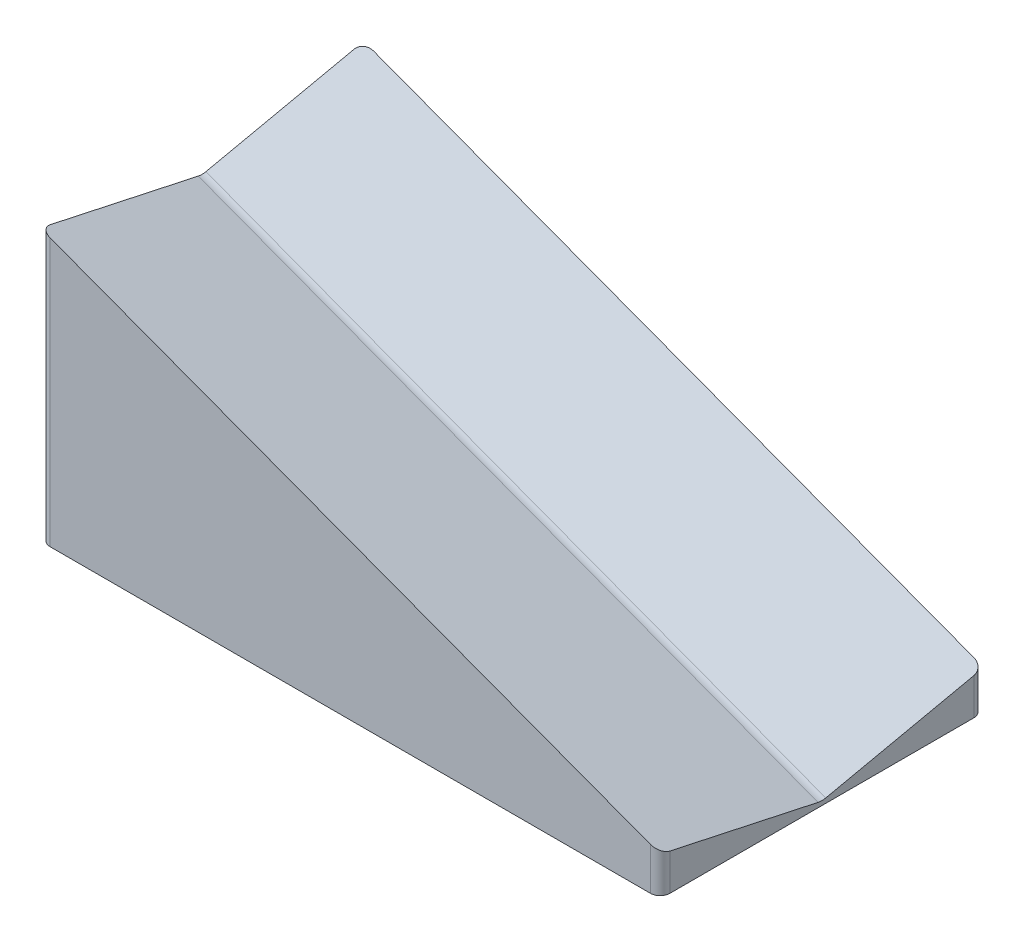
ISO-10303-21;
HEADER;
FILE_DESCRIPTION(('STEP AP214'),'2;1');
FILE_NAME('part.step','',(''),(''),'','','');
FILE_SCHEMA(('AUTOMOTIVE_DESIGN { 1 0 10303 214 1 1 1 1 }'));
ENDSEC;
DATA;
#1=APPLICATION_CONTEXT('core data for automotive mechanical design processes');
#2=APPLICATION_PROTOCOL_DEFINITION('international standard','automotive_design',2000,#1);
#3=PRODUCT_CONTEXT('',#1,'mechanical');
#4=PRODUCT('Part','Part','',(#3));
#5=PRODUCT_RELATED_PRODUCT_CATEGORY('part','',(#4));
#6=PRODUCT_DEFINITION_FORMATION('','',#4);
#7=PRODUCT_DEFINITION_CONTEXT('part definition',#1,'design');
#8=PRODUCT_DEFINITION('design','',#6,#7);
#9=PRODUCT_DEFINITION_SHAPE('','',#8);
#10=(LENGTH_UNIT() NAMED_UNIT(*) SI_UNIT(.MILLI.,.METRE.));
#11=(NAMED_UNIT(*) PLANE_ANGLE_UNIT() SI_UNIT($,.RADIAN.));
#12=(NAMED_UNIT(*) SI_UNIT($,.STERADIAN.) SOLID_ANGLE_UNIT());
#13=UNCERTAINTY_MEASURE_WITH_UNIT(LENGTH_MEASURE(1.E-05),#10,'distance_accuracy_value','');
#14=(GEOMETRIC_REPRESENTATION_CONTEXT(3) GLOBAL_UNCERTAINTY_ASSIGNED_CONTEXT((#13)) GLOBAL_UNIT_ASSIGNED_CONTEXT((#10,
#11,#12)) REPRESENTATION_CONTEXT('',''));
#15=CARTESIAN_POINT('',(0.,0.,0.));
#16=DIRECTION('',(0.,0.,1.));
#17=DIRECTION('',(1.,0.,0.));
#18=AXIS2_PLACEMENT_3D('',#15,#16,#17);
#19=CARTESIAN_POINT('',(0.,70.,41.75));
#20=DIRECTION('',(1.,0.,0.));
#21=DIRECTION('',(0.,1.,0.));
#22=AXIS2_PLACEMENT_3D('',#19,#20,#21);
#23=PLANE('',#22);
#24=DIRECTION('',(0.,-0.210728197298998,0.977544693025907));
#25=VECTOR('',#24,1.);
#26=CARTESIAN_POINT('',(0.,70.,-41.75));
#27=LINE('',#26,#25);
#28=CARTESIAN_POINT('',(0.,69.4610778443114,-39.25));
#29=VERTEX_POINT('',#28);
#30=CARTESIAN_POINT('',(0.,61.2132550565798,-0.989266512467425));
#31=VERTEX_POINT('',#30);
#32=EDGE_CURVE('E122',#29,#31,#27,.T.);
#33=ORIENTED_EDGE('',*,*,#32,.F.);
#34=DIRECTION('',(0.,-1.,0.));
#35=VECTOR('',#34,1.);
#36=CARTESIAN_POINT('',(0.,70.,-39.25));
#37=LINE('',#36,#35);
#38=CARTESIAN_POINT('',(0.,0.,-39.25));
#39=VERTEX_POINT('',#38);
#40=EDGE_CURVE('E135',#29,#39,#37,.T.);
#41=ORIENTED_EDGE('',*,*,#40,.T.);
#42=DIRECTION('',(0.,0.,-1.));
#43=VECTOR('',#42,1.);
#44=CARTESIAN_POINT('',(0.,0.,41.75));
#45=LINE('',#44,#43);
#46=CARTESIAN_POINT('',(0.,0.,39.25));
#47=VERTEX_POINT('',#46);
#48=EDGE_CURVE('E149',#47,#39,#45,.T.);
#49=ORIENTED_EDGE('',*,*,#48,.F.);
#50=DIRECTION('',(0.,-1.,0.));
#51=VECTOR('',#50,1.);
#52=CARTESIAN_POINT('',(0.,70.,39.25));
#53=LINE('',#52,#51);
#54=CARTESIAN_POINT('',(0.,69.4610778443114,39.25));
#55=VERTEX_POINT('',#54);
#56=EDGE_CURVE('E144',#47,#55,#53,.F.);
#57=ORIENTED_EDGE('',*,*,#56,.T.);
#58=DIRECTION('',(0.,0.210728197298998,0.977544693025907));
#59=VECTOR('',#58,1.);
#60=CARTESIAN_POINT('',(0.,61.,0.));
#61=LINE('',#60,#59);
#62=CARTESIAN_POINT('',(0.,61.2132550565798,0.989266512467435));
#63=VERTEX_POINT('',#62);
#64=EDGE_CURVE('E138',#63,#55,#61,.T.);
#65=ORIENTED_EDGE('',*,*,#64,.F.);
#66=CARTESIAN_POINT('',(0.,66.4476943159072,0.));
#67=DIRECTION('',(1.,0.,0.));
#68=DIRECTION('',(0.,1.,0.));
#69=AXIS2_PLACEMENT_3D('',#66,#67,#68);
#70=ELLIPSE('',#69,5.34000234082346,5.);
#71=EDGE_CURVE('E12',#63,#31,#70,.T.);
#72=ORIENTED_EDGE('',*,*,#71,.T.);
#73=EDGE_LOOP('',(#33,#41,#49,#57,#65,#72));
#74=FACE_BOUND('',#73,.T.);
#75=ADVANCED_FACE('F41',(#74),#23,.F.);
#76=CARTESIAN_POINT('',(160.,0.,41.75));
#77=DIRECTION('',(-1.,0.,0.));
#78=DIRECTION('',(0.,0.,1.));
#79=AXIS2_PLACEMENT_3D('',#76,#77,#78);
#80=PLANE('',#79);
#81=DIRECTION('',(0.,0.,-1.));
#82=VECTOR('',#81,1.);
#83=CARTESIAN_POINT('',(160.,0.,41.75));
#84=LINE('',#83,#82);
#85=CARTESIAN_POINT('',(160.,0.,39.25));
#86=VERTEX_POINT('',#85);
#87=CARTESIAN_POINT('',(160.,0.,-39.25));
#88=VERTEX_POINT('',#87);
#89=EDGE_CURVE('E215',#86,#88,#84,.T.);
#90=ORIENTED_EDGE('',*,*,#89,.T.);
#91=DIRECTION('',(0.,1.,0.));
#92=VECTOR('',#91,1.);
#93=CARTESIAN_POINT('',(160.,0.,-39.25));
#94=LINE('',#93,#92);
#95=CARTESIAN_POINT('',(160.,9.46107784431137,-39.25));
#96=VERTEX_POINT('',#95);
#97=EDGE_CURVE('E175',#88,#96,#94,.T.);
#98=ORIENTED_EDGE('',*,*,#97,.T.);
#99=DIRECTION('',(0.,0.210728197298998,-0.977544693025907));
#100=VECTOR('',#99,1.);
#101=CARTESIAN_POINT('',(160.,10.,-41.75));
#102=LINE('',#101,#100);
#103=CARTESIAN_POINT('',(160.,1.21325505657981,-0.989266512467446));
#104=VERTEX_POINT('',#103);
#105=EDGE_CURVE('E172',#104,#96,#102,.T.);
#106=ORIENTED_EDGE('',*,*,#105,.F.);
#107=CARTESIAN_POINT('',(160.,6.44769431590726,0.));
#108=DIRECTION('',(-1.,0.,0.));
#109=DIRECTION('',(0.,1.,0.));
#110=AXIS2_PLACEMENT_3D('',#107,#108,#109);
#111=ELLIPSE('',#110,5.34000234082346,5.);
#112=CARTESIAN_POINT('',(160.,1.2132550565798,0.989266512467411));
#113=VERTEX_POINT('',#112);
#114=EDGE_CURVE('E49',#104,#113,#111,.T.);
#115=ORIENTED_EDGE('',*,*,#114,.T.);
#116=DIRECTION('',(0.,-0.210728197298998,-0.977544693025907));
#117=VECTOR('',#116,1.);
#118=CARTESIAN_POINT('',(160.,1.,0.));
#119=LINE('',#118,#117);
#120=CARTESIAN_POINT('',(160.,9.46107784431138,39.25));
#121=VERTEX_POINT('',#120);
#122=EDGE_CURVE('E139',#121,#113,#119,.T.);
#123=ORIENTED_EDGE('',*,*,#122,.F.);
#124=DIRECTION('',(0.,1.,0.));
#125=VECTOR('',#124,1.);
#126=CARTESIAN_POINT('',(160.,0.,39.25));
#127=LINE('',#126,#125);
#128=EDGE_CURVE('E129',#121,#86,#127,.F.);
#129=ORIENTED_EDGE('',*,*,#128,.T.);
#130=EDGE_LOOP('',(#90,#98,#106,#115,#123,#129));
#131=FACE_BOUND('',#130,.T.);
#132=ADVANCED_FACE('F231',(#131),#80,.F.);
#133=CARTESIAN_POINT('',(0.,0.,41.75));
#134=DIRECTION('',(0.,1.,0.));
#135=DIRECTION('',(0.,0.,1.));
#136=AXIS2_PLACEMENT_3D('',#133,#134,#135);
#137=PLANE('',#136);
#138=ORIENTED_EDGE('',*,*,#48,.T.);
#139=CARTESIAN_POINT('',(2.5,0.,-39.25));
#140=DIRECTION('',(0.,1.,0.));
#141=DIRECTION('',(0.,0.,1.));
#142=AXIS2_PLACEMENT_3D('',#139,#140,#141);
#143=CIRCLE('',#142,2.5);
#144=CARTESIAN_POINT('',(2.5,0.,-41.75));
#145=VERTEX_POINT('',#144);
#146=EDGE_CURVE('E142',#39,#145,#143,.F.);
#147=ORIENTED_EDGE('',*,*,#146,.T.);
#148=DIRECTION('',(1.,0.,0.));
#149=VECTOR('',#148,1.);
#150=CARTESIAN_POINT('',(0.,0.,-41.75));
#151=LINE('',#150,#149);
#152=CARTESIAN_POINT('',(157.5,0.,-41.75));
#153=VERTEX_POINT('',#152);
#154=EDGE_CURVE('E159',#145,#153,#151,.T.);
#155=ORIENTED_EDGE('',*,*,#154,.T.);
#156=CARTESIAN_POINT('',(157.5,0.,-39.25));
#157=DIRECTION('',(0.,1.,0.));
#158=DIRECTION('',(0.,0.,1.));
#159=AXIS2_PLACEMENT_3D('',#156,#157,#158);
#160=CIRCLE('',#159,2.5);
#161=EDGE_CURVE('E153',#153,#88,#160,.F.);
#162=ORIENTED_EDGE('',*,*,#161,.T.);
#163=ORIENTED_EDGE('',*,*,#89,.F.);
#164=CARTESIAN_POINT('',(157.5,0.,39.25));
#165=DIRECTION('',(0.,1.,0.));
#166=DIRECTION('',(0.,0.,1.));
#167=AXIS2_PLACEMENT_3D('',#164,#165,#166);
#168=CIRCLE('',#167,2.5);
#169=CARTESIAN_POINT('',(157.5,0.,41.75));
#170=VERTEX_POINT('',#169);
#171=EDGE_CURVE('E146',#86,#170,#168,.F.);
#172=ORIENTED_EDGE('',*,*,#171,.T.);
#173=DIRECTION('',(1.,0.,0.));
#174=VECTOR('',#173,1.);
#175=CARTESIAN_POINT('',(0.,0.,41.75));
#176=LINE('',#175,#174);
#177=CARTESIAN_POINT('',(2.5,0.,41.75));
#178=VERTEX_POINT('',#177);
#179=EDGE_CURVE('E182',#178,#170,#176,.T.);
#180=ORIENTED_EDGE('',*,*,#179,.F.);
#181=CARTESIAN_POINT('',(2.5,0.,39.25));
#182=DIRECTION('',(0.,1.,0.));
#183=DIRECTION('',(0.,0.,1.));
#184=AXIS2_PLACEMENT_3D('',#181,#182,#183);
#185=CIRCLE('',#184,2.5);
#186=EDGE_CURVE('E143',#178,#47,#185,.F.);
#187=ORIENTED_EDGE('',*,*,#186,.T.);
#188=EDGE_LOOP('',(#138,#147,#155,#162,#163,#172,#180,#187));
#189=FACE_BOUND('',#188,.T.);
#190=ADVANCED_FACE('F212',(#189),#137,.F.);
#191=CARTESIAN_POINT('',(0.,0.,41.75));
#192=DIRECTION('',(0.,0.,1.));
#193=DIRECTION('',(1.,0.,0.));
#194=AXIS2_PLACEMENT_3D('',#191,#192,#193);
#195=PLANE('',#194);
#196=ORIENTED_EDGE('',*,*,#179,.T.);
#197=DIRECTION('',(0.,1.,0.));
#198=VECTOR('',#197,1.);
#199=CARTESIAN_POINT('',(157.5,10.,41.75));
#200=LINE('',#199,#198);
#201=CARTESIAN_POINT('',(157.5,10.9375,41.75));
#202=VERTEX_POINT('',#201);
#203=EDGE_CURVE('E185',#170,#202,#200,.T.);
#204=ORIENTED_EDGE('',*,*,#203,.T.);
#205=DIRECTION('',(-0.936329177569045,0.351123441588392,0.));
#206=VECTOR('',#205,1.);
#207=CARTESIAN_POINT('',(160.,10.,41.75));
#208=LINE('',#207,#206);
#209=CARTESIAN_POINT('',(2.49999999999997,69.0625,41.75));
#210=VERTEX_POINT('',#209);
#211=EDGE_CURVE('E179',#202,#210,#208,.T.);
#212=ORIENTED_EDGE('',*,*,#211,.T.);
#213=DIRECTION('',(0.,-1.,0.));
#214=VECTOR('',#213,1.);
#215=CARTESIAN_POINT('',(2.5,0.,41.75));
#216=LINE('',#215,#214);
#217=EDGE_CURVE('E178',#210,#178,#216,.T.);
#218=ORIENTED_EDGE('',*,*,#217,.T.);
#219=EDGE_LOOP('',(#196,#204,#212,#218));
#220=FACE_BOUND('',#219,.T.);
#221=ADVANCED_FACE('F209',(#220),#195,.T.);
#222=CARTESIAN_POINT('',(0.,0.,-41.75));
#223=DIRECTION('',(0.,0.,1.));
#224=DIRECTION('',(1.,0.,0.));
#225=AXIS2_PLACEMENT_3D('',#222,#223,#224);
#226=PLANE('',#225);
#227=ORIENTED_EDGE('',*,*,#154,.F.);
#228=DIRECTION('',(0.,-1.,0.));
#229=VECTOR('',#228,1.);
#230=CARTESIAN_POINT('',(2.5,0.,-41.75));
#231=LINE('',#230,#229);
#232=CARTESIAN_POINT('',(2.49999999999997,69.0625,-41.75));
#233=VERTEX_POINT('',#232);
#234=EDGE_CURVE('E225',#145,#233,#231,.F.);
#235=ORIENTED_EDGE('',*,*,#234,.T.);
#236=DIRECTION('',(-0.936329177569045,0.351123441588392,0.));
#237=VECTOR('',#236,1.);
#238=CARTESIAN_POINT('',(160.,10.,-41.75));
#239=LINE('',#238,#237);
#240=CARTESIAN_POINT('',(157.5,10.9375,-41.75));
#241=VERTEX_POINT('',#240);
#242=EDGE_CURVE('E125',#241,#233,#239,.T.);
#243=ORIENTED_EDGE('',*,*,#242,.F.);
#244=DIRECTION('',(0.,1.,0.));
#245=VECTOR('',#244,1.);
#246=CARTESIAN_POINT('',(157.5,0.,-41.75));
#247=LINE('',#246,#245);
#248=EDGE_CURVE('E156',#241,#153,#247,.F.);
#249=ORIENTED_EDGE('',*,*,#248,.T.);
#250=EDGE_LOOP('',(#227,#235,#243,#249));
#251=FACE_BOUND('',#250,.T.);
#252=ADVANCED_FACE('F224',(#251),#226,.F.);
#253=CARTESIAN_POINT('',(19.2697309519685,51.3859492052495,11.0772106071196));
#254=DIRECTION('',(0.344182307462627,0.917819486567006,0.197853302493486));
#255=DIRECTION('',(-0.936329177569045,0.351123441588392,0.));
#256=AXIS2_PLACEMENT_3D('',#253,#254,#255);
#257=PLANE('',#256);
#258=ORIENTED_EDGE('',*,*,#32,.T.);
#259=DIRECTION('',(0.936329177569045,-0.351123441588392,0.));
#260=VECTOR('',#259,1.);
#261=CARTESIAN_POINT('',(160.070111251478,1.18696333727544,-0.989266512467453));
#262=LINE('',#261,#260);
#263=EDGE_CURVE('E192',#31,#104,#262,.T.);
#264=ORIENTED_EDGE('',*,*,#263,.T.);
#265=ORIENTED_EDGE('',*,*,#105,.T.);
#266=CARTESIAN_POINT('',(157.5,10.3985778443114,-39.25));
#267=DIRECTION('',(0.344182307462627,0.917819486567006,0.197853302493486));
#268=DIRECTION('',(-0.795714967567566,0.396997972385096,-0.457416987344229));
#269=AXIS2_PLACEMENT_3D('',#266,#267,#268);
#270=ELLIPSE('',#269,2.72384715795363,2.5);
#271=EDGE_CURVE('E130',#96,#241,#270,.T.);
#272=ORIENTED_EDGE('',*,*,#271,.T.);
#273=ORIENTED_EDGE('',*,*,#242,.T.);
#274=CARTESIAN_POINT('',(2.5,68.5235778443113,-39.25));
#275=DIRECTION('',(0.344182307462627,0.917819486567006,0.197853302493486));
#276=DIRECTION('',(0.795714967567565,-0.396997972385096,0.457416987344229));
#277=AXIS2_PLACEMENT_3D('',#274,#275,#276);
#278=ELLIPSE('',#277,2.72384715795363,2.5);
#279=EDGE_CURVE('E118',#233,#29,#278,.T.);
#280=ORIENTED_EDGE('',*,*,#279,.T.);
#281=EDGE_LOOP('',(#258,#264,#265,#272,#273,#280));
#282=FACE_BOUND('',#281,.T.);
#283=ADVANCED_FACE('F120',(#282),#257,.T.);
#284=CARTESIAN_POINT('',(19.2697309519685,51.3859492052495,-11.0772106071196));
#285=DIRECTION('',(0.344182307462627,0.917819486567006,-0.197853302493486));
#286=DIRECTION('',(-0.936329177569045,0.351123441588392,0.));
#287=AXIS2_PLACEMENT_3D('',#284,#285,#286);
#288=PLANE('',#287);
#289=ORIENTED_EDGE('',*,*,#122,.T.);
#290=DIRECTION('',(0.936329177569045,-0.351123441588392,0.));
#291=VECTOR('',#290,1.);
#292=CARTESIAN_POINT('',(0.0701112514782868,61.1869633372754,0.98926651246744));
#293=LINE('',#292,#291);
#294=EDGE_CURVE('E56',#113,#63,#293,.F.);
#295=ORIENTED_EDGE('',*,*,#294,.T.);
#296=ORIENTED_EDGE('',*,*,#64,.T.);
#297=CARTESIAN_POINT('',(2.5,68.5235778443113,39.25));
#298=DIRECTION('',(0.344182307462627,0.917819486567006,-0.197853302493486));
#299=DIRECTION('',(-0.795714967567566,0.396997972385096,0.45741698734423));
#300=AXIS2_PLACEMENT_3D('',#297,#298,#299);
#301=ELLIPSE('',#300,2.72384715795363,2.5);
#302=EDGE_CURVE('E188',#55,#210,#301,.T.);
#303=ORIENTED_EDGE('',*,*,#302,.T.);
#304=ORIENTED_EDGE('',*,*,#211,.F.);
#305=CARTESIAN_POINT('',(157.5,10.3985778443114,39.25));
#306=DIRECTION('',(0.344182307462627,0.917819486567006,-0.197853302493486));
#307=DIRECTION('',(0.795714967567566,-0.396997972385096,-0.457416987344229));
#308=AXIS2_PLACEMENT_3D('',#305,#306,#307);
#309=ELLIPSE('',#308,2.72384715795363,2.5);
#310=EDGE_CURVE('E190',#202,#121,#309,.T.);
#311=ORIENTED_EDGE('',*,*,#310,.T.);
#312=EDGE_LOOP('',(#289,#295,#296,#303,#304,#311));
#313=FACE_BOUND('',#312,.T.);
#314=ADVANCED_FACE('F199',(#313),#288,.T.);
#315=CARTESIAN_POINT('',(2.5,70.,-39.25));
#316=DIRECTION('',(0.,-1.,0.));
#317=DIRECTION('',(1.,0.,0.));
#318=AXIS2_PLACEMENT_3D('',#315,#316,#317);
#319=CYLINDRICAL_SURFACE('',#318,2.5);
#320=ORIENTED_EDGE('',*,*,#279,.F.);
#321=ORIENTED_EDGE('',*,*,#234,.F.);
#322=ORIENTED_EDGE('',*,*,#146,.F.);
#323=ORIENTED_EDGE('',*,*,#40,.F.);
#324=EDGE_LOOP('',(#320,#321,#322,#323));
#325=FACE_BOUND('',#324,.T.);
#326=ADVANCED_FACE('F141',(#325),#319,.T.);
#327=CARTESIAN_POINT('',(157.5,0.,-39.25));
#328=DIRECTION('',(0.,1.,0.));
#329=DIRECTION('',(0.,0.,1.));
#330=AXIS2_PLACEMENT_3D('',#327,#328,#329);
#331=CYLINDRICAL_SURFACE('',#330,2.5);
#332=ORIENTED_EDGE('',*,*,#161,.F.);
#333=ORIENTED_EDGE('',*,*,#248,.F.);
#334=ORIENTED_EDGE('',*,*,#271,.F.);
#335=ORIENTED_EDGE('',*,*,#97,.F.);
#336=EDGE_LOOP('',(#332,#333,#334,#335));
#337=FACE_BOUND('',#336,.T.);
#338=ADVANCED_FACE('F230',(#337),#331,.T.);
#339=CARTESIAN_POINT('',(157.5,0.,39.25));
#340=DIRECTION('',(0.,-1.,0.));
#341=DIRECTION('',(0.,0.,-1.));
#342=AXIS2_PLACEMENT_3D('',#339,#340,#341);
#343=CYLINDRICAL_SURFACE('',#342,2.5);
#344=ORIENTED_EDGE('',*,*,#171,.F.);
#345=ORIENTED_EDGE('',*,*,#128,.F.);
#346=ORIENTED_EDGE('',*,*,#310,.F.);
#347=ORIENTED_EDGE('',*,*,#203,.F.);
#348=EDGE_LOOP('',(#344,#345,#346,#347));
#349=FACE_BOUND('',#348,.T.);
#350=ADVANCED_FACE('F234',(#349),#343,.T.);
#351=CARTESIAN_POINT('',(2.5,0.,39.25));
#352=DIRECTION('',(0.,1.,0.));
#353=DIRECTION('',(-1.,0.,0.));
#354=AXIS2_PLACEMENT_3D('',#351,#352,#353);
#355=CYLINDRICAL_SURFACE('',#354,2.5);
#356=ORIENTED_EDGE('',*,*,#302,.F.);
#357=ORIENTED_EDGE('',*,*,#56,.F.);
#358=ORIENTED_EDGE('',*,*,#186,.F.);
#359=ORIENTED_EDGE('',*,*,#217,.F.);
#360=EDGE_LOOP('',(#356,#357,#358,#359));
#361=FACE_BOUND('',#360,.T.);
#362=ADVANCED_FACE('F205',(#361),#355,.T.);
#363=CARTESIAN_POINT('',(21.8458173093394,58.255512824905,0.));
#364=DIRECTION('',(-0.936329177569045,0.351123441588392,0.));
#365=DIRECTION('',(-0.351123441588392,-0.936329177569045,0.));
#366=AXIS2_PLACEMENT_3D('',#363,#364,#365);
#367=CYLINDRICAL_SURFACE('',#366,5.);
#368=ORIENTED_EDGE('',*,*,#71,.F.);
#369=ORIENTED_EDGE('',*,*,#294,.F.);
#370=ORIENTED_EDGE('',*,*,#114,.F.);
#371=ORIENTED_EDGE('',*,*,#263,.F.);
#372=EDGE_LOOP('',(#368,#369,#370,#371));
#373=FACE_BOUND('',#372,.T.);
#374=ADVANCED_FACE('F43',(#373),#367,.F.);
#375=CLOSED_SHELL('',(#75,#132,#190,#221,#252,#283,#314,#326,#338,#350,#362,#374));
#376=MANIFOLD_SOLID_BREP('B2',#375);
#377=ADVANCED_BREP_SHAPE_REPRESENTATION('',(#18,#376),#14);
#378=SHAPE_DEFINITION_REPRESENTATION(#9,#377);
ENDSEC;
END-ISO-10303-21;
